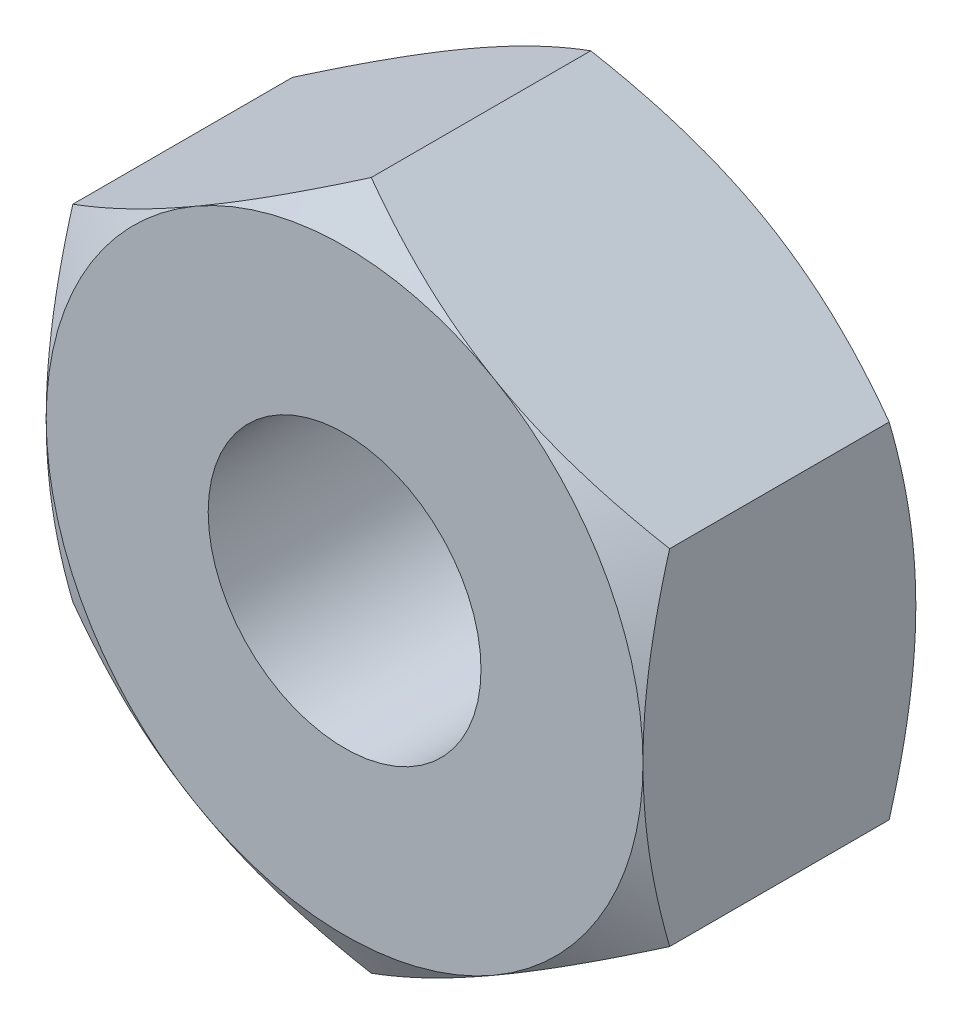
ISO-10303-21;
HEADER;
FILE_DESCRIPTION(('STEP AP214'),'2;1');
FILE_NAME('part.step','',(''),(''),'','','');
FILE_SCHEMA(('AUTOMOTIVE_DESIGN { 1 0 10303 214 1 1 1 1 }'));
ENDSEC;
DATA;
#1=APPLICATION_CONTEXT('core data for automotive mechanical design processes');
#2=APPLICATION_PROTOCOL_DEFINITION('international standard','automotive_design',2000,#1);
#3=PRODUCT_CONTEXT('',#1,'mechanical');
#4=PRODUCT('Part','Part','',(#3));
#5=PRODUCT_RELATED_PRODUCT_CATEGORY('part','',(#4));
#6=PRODUCT_DEFINITION_FORMATION('','',#4);
#7=PRODUCT_DEFINITION_CONTEXT('part definition',#1,'design');
#8=PRODUCT_DEFINITION('design','',#6,#7);
#9=PRODUCT_DEFINITION_SHAPE('','',#8);
#10=(LENGTH_UNIT() NAMED_UNIT(*) SI_UNIT(.MILLI.,.METRE.));
#11=(NAMED_UNIT(*) PLANE_ANGLE_UNIT() SI_UNIT($,.RADIAN.));
#12=(NAMED_UNIT(*) SI_UNIT($,.STERADIAN.) SOLID_ANGLE_UNIT());
#13=UNCERTAINTY_MEASURE_WITH_UNIT(LENGTH_MEASURE(1.E-05),#10,'distance_accuracy_value','');
#14=(GEOMETRIC_REPRESENTATION_CONTEXT(3) GLOBAL_UNCERTAINTY_ASSIGNED_CONTEXT((#13)) GLOBAL_UNIT_ASSIGNED_CONTEXT((#10,
#11,#12)) REPRESENTATION_CONTEXT('',''));
#15=CARTESIAN_POINT('',(0.,0.,0.));
#16=DIRECTION('',(0.,0.,1.));
#17=DIRECTION('',(1.,0.,0.));
#18=AXIS2_PLACEMENT_3D('',#15,#16,#17);
#19=CARTESIAN_POINT('',(-3.5,6.06217782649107,0.));
#20=DIRECTION('',(0.,0.,-1.));
#21=DIRECTION('',(-1.,0.,0.));
#22=AXIS2_PLACEMENT_3D('',#19,#20,#21);
#23=PLANE('',#22);
#24=CARTESIAN_POINT('',(0.,0.,0.));
#25=DIRECTION('',(0.,0.,1.));
#26=DIRECTION('',(1.,0.,0.));
#27=AXIS2_PLACEMENT_3D('',#24,#25,#26);
#28=CIRCLE('',#27,1.6);
#29=CARTESIAN_POINT('',(1.6,0.,0.));
#30=VERTEX_POINT('',#29);
#31=EDGE_CURVE('E315',#30,#30,#28,.T.);
#32=ORIENTED_EDGE('',*,*,#31,.F.);
#33=EDGE_LOOP('',(#32));
#34=FACE_BOUND('',#33,.T.);
#35=CARTESIAN_POINT('',(0.,0.,0.));
#36=DIRECTION('',(0.,0.,-1.));
#37=DIRECTION('',(-1.,0.,0.));
#38=AXIS2_PLACEMENT_3D('',#35,#36,#37);
#39=CIRCLE('',#38,3.5);
#40=CARTESIAN_POINT('',(-3.5,0.,0.));
#41=VERTEX_POINT('',#40);
#42=CARTESIAN_POINT('',(-1.75,3.03108891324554,0.));
#43=VERTEX_POINT('',#42);
#44=EDGE_CURVE('E323',#41,#43,#39,.T.);
#45=ORIENTED_EDGE('',*,*,#44,.F.);
#46=CARTESIAN_POINT('',(0.,0.,0.));
#47=DIRECTION('',(0.,0.,-1.));
#48=DIRECTION('',(-1.,0.,0.));
#49=AXIS2_PLACEMENT_3D('',#46,#47,#48);
#50=CIRCLE('',#49,3.5);
#51=CARTESIAN_POINT('',(-1.75,-3.03108891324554,0.));
#52=VERTEX_POINT('',#51);
#53=EDGE_CURVE('E145',#41,#52,#50,.F.);
#54=ORIENTED_EDGE('',*,*,#53,.T.);
#55=CARTESIAN_POINT('',(1.75,-3.03108891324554,0.));
#56=VERTEX_POINT('',#55);
#57=EDGE_CURVE('E247',#52,#56,#50,.F.);
#58=ORIENTED_EDGE('',*,*,#57,.T.);
#59=CARTESIAN_POINT('',(3.5,0.,0.));
#60=VERTEX_POINT('',#59);
#61=EDGE_CURVE('E148',#56,#60,#50,.F.);
#62=ORIENTED_EDGE('',*,*,#61,.T.);
#63=CARTESIAN_POINT('',(1.75,3.03108891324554,0.));
#64=VERTEX_POINT('',#63);
#65=EDGE_CURVE('E123',#60,#64,#50,.F.);
#66=ORIENTED_EDGE('',*,*,#65,.T.);
#67=EDGE_CURVE('E136',#64,#43,#50,.F.);
#68=ORIENTED_EDGE('',*,*,#67,.T.);
#69=EDGE_LOOP('',(#45,#54,#58,#62,#66,#68));
#70=FACE_BOUND('',#69,.T.);
#71=ADVANCED_FACE('F28',(#34,#70),#23,.F.);
#72=CARTESIAN_POINT('',(0.,0.,0.));
#73=DIRECTION('',(0.,0.,-1.));
#74=DIRECTION('',(-1.,0.,0.));
#75=AXIS2_PLACEMENT_3D('',#72,#73,#74);
#76=CONICAL_SURFACE('',#75,3.5,1.0471975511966);
#77=CARTESIAN_POINT('',(-3.5,-5.53989236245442,-1.76258862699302));
#78=CARTESIAN_POINT('',(-3.5,-5.3860532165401,-1.68751948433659));
#79=CARTESIAN_POINT('',(-3.5,-5.23187272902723,-1.61313843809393));
#80=CARTESIAN_POINT('',(-3.5,-4.92264796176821,-1.46613741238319));
#81=CARTESIAN_POINT('',(-3.5,-4.76760355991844,-1.39351769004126));
#82=CARTESIAN_POINT('',(-3.5,-4.45572331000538,-1.25008237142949));
#83=CARTESIAN_POINT('',(-3.5,-4.29888236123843,-1.17927782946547));
#84=CARTESIAN_POINT('',(-3.5,-3.9839916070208,-1.04042037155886));
#85=CARTESIAN_POINT('',(-3.5,-3.82594185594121,-0.972367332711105));
#86=CARTESIAN_POINT('',(-3.5,-3.50286160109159,-0.837429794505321));
#87=CARTESIAN_POINT('',(-3.5,-3.33777947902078,-0.770668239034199));
#88=CARTESIAN_POINT('',(-3.5,-3.00572557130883,-0.641932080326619));
#89=CARTESIAN_POINT('',(-3.5,-2.83875358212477,-0.579957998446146));
#90=CARTESIAN_POINT('',(-3.5,-2.50293236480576,-0.462342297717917));
#91=CARTESIAN_POINT('',(-3.5,-2.33408734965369,-0.40668876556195));
#92=CARTESIAN_POINT('',(-3.5,-1.99397751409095,-0.303425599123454));
#93=CARTESIAN_POINT('',(-3.5,-1.82271343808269,-0.255813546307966));
#94=CARTESIAN_POINT('',(-3.5,-1.4786457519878,-0.171103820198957));
#95=CARTESIAN_POINT('',(-3.5,-1.30585748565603,-0.133944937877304));
#96=CARTESIAN_POINT('',(-3.5,-0.958019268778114,-0.0721569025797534));
#97=CARTESIAN_POINT('',(-3.5,-0.782969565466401,-0.04752639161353));
#98=CARTESIAN_POINT('',(-3.5,-0.433812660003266,-0.0130761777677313));
#99=CARTESIAN_POINT('',(-3.5,-0.259725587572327,-0.00305750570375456));
#100=CARTESIAN_POINT('',(-3.5,0.0886801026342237,0.00185116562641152));
#101=CARTESIAN_POINT('',(-3.5,0.262998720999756,-0.00325887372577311));
#102=CARTESIAN_POINT('',(-3.5,0.555719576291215,-0.0241715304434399));
#103=CARTESIAN_POINT('',(-3.5,0.674418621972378,-0.0360937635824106));
#104=CARTESIAN_POINT('',(-3.5,0.911014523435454,-0.0662689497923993));
#105=CARTESIAN_POINT('',(-3.5,1.02891127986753,-0.0845226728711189));
#106=CARTESIAN_POINT('',(-3.5,1.38120423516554,-0.147828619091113));
#107=CARTESIAN_POINT('',(-3.5,1.6140874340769,-0.201416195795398));
#108=CARTESIAN_POINT('',(-3.5,1.96246692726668,-0.295188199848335));
#109=CARTESIAN_POINT('',(-3.5,2.07974536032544,-0.329136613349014));
#110=CARTESIAN_POINT('',(-3.5,2.31316562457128,-0.400772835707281));
#111=CARTESIAN_POINT('',(-3.5,2.42930744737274,-0.438460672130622));
#112=CARTESIAN_POINT('',(-3.5,2.66048730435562,-0.516953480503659));
#113=CARTESIAN_POINT('',(-3.5,2.77552563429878,-0.557757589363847));
#114=CARTESIAN_POINT('',(-3.5,3.00463505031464,-0.641981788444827));
#115=CARTESIAN_POINT('',(-3.5,3.11870615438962,-0.685401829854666));
#116=CARTESIAN_POINT('',(-3.5,3.41088605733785,-0.799847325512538));
#117=CARTESIAN_POINT('',(-3.5,3.58836543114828,-0.872477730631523));
#118=CARTESIAN_POINT('',(-3.5,3.9415935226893,-1.02184558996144));
#119=CARTESIAN_POINT('',(-3.5,4.11734207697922,-1.09858342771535));
#120=CARTESIAN_POINT('',(-3.5,4.46747042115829,-1.25524955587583));
#121=CARTESIAN_POINT('',(-3.5,4.64184978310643,-1.33517879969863));
#122=CARTESIAN_POINT('',(-3.5,4.98945002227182,-1.49752225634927));
#123=CARTESIAN_POINT('',(-3.5,5.16267086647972,-1.57993653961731));
#124=CARTESIAN_POINT('',(-3.5,5.68141043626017,-1.83034120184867));
#125=CARTESIAN_POINT('',(-3.5,6.02551030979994,-2.00126768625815));
#126=CARTESIAN_POINT('',(-3.5,6.71106540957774,-2.34815565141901));
#127=CARTESIAN_POINT('',(-3.5,7.05252109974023,-2.52411622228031));
#128=CARTESIAN_POINT('',(-3.5,7.70032644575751,-2.86216222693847));
#129=CARTESIAN_POINT('',(-3.5,8.00684578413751,-3.02392309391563));
#130=CARTESIAN_POINT('',(-3.5,8.61878605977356,-3.34954435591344));
#131=CARTESIAN_POINT('',(-3.5,8.92420693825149,-3.51340486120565));
#132=CARTESIAN_POINT('',(-3.5,9.53323628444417,-3.84217810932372));
#133=CARTESIAN_POINT('',(-3.5,9.836847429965,-4.00708589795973));
#134=CARTESIAN_POINT('',(-3.5,10.4433788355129,-4.33811602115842));
#135=CARTESIAN_POINT('',(-3.5,10.746299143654,-4.50423826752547));
#136=CARTESIAN_POINT('',(-3.5,11.0489725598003,-4.67080588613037));
#137=B_SPLINE_CURVE_WITH_KNOTS('',3,(#77,#78,#79,#80,#81,#82,#83,#84,#85,#86,#87,#88,#89,#90,
#91,#92,#93,#94,#95,#96,#97,#98,#99,#100,#101,#102,#103,#104,#105,#106,#107,#108,#109,#110,#111,
#112,#113,#114,#115,#116,#117,#118,#119,#120,#121,#122,#123,#124,#125,#126,#127,#128,#129,#130,
#131,#132,#133,#134,#135,#136),.UNSPECIFIED.,.F.,.F.,(4,2,2,2,2,2,2,2,2,2,2,2,2,2,2,2,2,2,2,2,2,
2,2,2,2,2,2,2,2,4),(0.,0.513539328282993,1.02715317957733,1.5433792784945,2.0595822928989,
2.59373725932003,3.12795031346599,3.6611391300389,4.19416729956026,4.72400604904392,
5.25378735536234,5.77628502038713,6.29878401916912,6.65650136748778,7.0142622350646,
7.73013057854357,8.09637575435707,8.46262363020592,8.82877043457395,9.19491040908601,
9.77013340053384,10.3454101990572,10.9208601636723,11.4963264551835,12.6488931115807,
13.8012527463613,14.840994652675,15.8807913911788,16.9173059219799,17.9537459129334),.UNSPECIFIED.);
#138=CARTESIAN_POINT('',(-3.5,2.0207259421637,-0.312607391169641));
#139=VERTEX_POINT('',#138);
#140=EDGE_CURVE('E153',#139,#41,#137,.F.);
#141=ORIENTED_EDGE('',*,*,#140,.T.);
#142=ORIENTED_EDGE('',*,*,#44,.T.);
#143=CARTESIAN_POINT('',(0.0002,4.04156735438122,-0.312674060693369));
#144=CARTESIAN_POINT('',(-0.153607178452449,3.9527667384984,-0.261385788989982));
#145=CARTESIAN_POINT('',(-0.308742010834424,3.86319960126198,-0.214740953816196));
#146=CARTESIAN_POINT('',(-0.621698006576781,3.68251437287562,-0.133321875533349));
#147=CARTESIAN_POINT('',(-0.779524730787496,3.59139307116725,-0.0985764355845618));
#148=CARTESIAN_POINT('',(-1.09322221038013,3.41027974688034,-0.0444900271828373));
#149=CARTESIAN_POINT('',(-1.24904469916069,3.32031559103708,-0.0247890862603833));
#150=CARTESIAN_POINT('',(-1.56142288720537,3.13996396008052,-0.0012701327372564));
#151=CARTESIAN_POINT('',(-1.71797745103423,3.04957714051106,0.00256735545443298));
#152=CARTESIAN_POINT('',(-2.01050921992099,2.88068384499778,-0.00541530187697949));
#153=CARTESIAN_POINT('',(-2.14653021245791,2.80215208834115,-0.0152754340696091));
#154=CARTESIAN_POINT('',(-2.41768602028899,2.64560020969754,-0.0465264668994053));
#155=CARTESIAN_POINT('',(-2.55281989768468,2.5675806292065,-0.0679280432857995));
#156=CARTESIAN_POINT('',(-2.82453479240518,2.41070596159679,-0.121430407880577));
#157=CARTESIAN_POINT('',(-2.96108141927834,2.33187072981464,-0.153757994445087));
#158=CARTESIAN_POINT('',(-3.2321380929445,2.17537608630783,-0.227128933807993));
#159=CARTESIAN_POINT('',(-3.36665161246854,2.09771466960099,-0.268155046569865));
#160=CARTESIAN_POINT('',(-3.5002,2.02061047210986,-0.312674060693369));
#161=B_SPLINE_CURVE_WITH_KNOTS('',3,(#143,#144,#145,#146,#147,#148,#149,#150,#151,#152,#153,
#154,#155,#156,#157,#158,#159,#160),.UNSPECIFIED.,.F.,.F.,(4,2,2,2,2,2,2,2,4),(0.,
0.554793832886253,1.11092123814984,1.65328467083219,2.19498204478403,2.6666513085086,
3.13875761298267,3.62133612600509,4.10296698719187),.UNSPECIFIED.);
#162=EDGE_CURVE('E185',#43,#139,#161,.T.);
#163=ORIENTED_EDGE('',*,*,#162,.T.);
#164=EDGE_LOOP('',(#141,#142,#163));
#165=FACE_BOUND('',#164,.T.);
#166=ADVANCED_FACE('F172',(#165),#76,.T.);
#167=CARTESIAN_POINT('',(3.5002,2.02061047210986,-0.312674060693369));
#168=CARTESIAN_POINT('',(3.34639282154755,2.10941108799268,-0.261385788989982));
#169=CARTESIAN_POINT('',(3.19125798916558,2.1989782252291,-0.214740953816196));
#170=CARTESIAN_POINT('',(2.87830199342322,2.37966345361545,-0.133321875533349));
#171=CARTESIAN_POINT('',(2.7204752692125,2.47078475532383,-0.0985764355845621));
#172=CARTESIAN_POINT('',(2.40677778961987,2.65189807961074,-0.0444900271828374));
#173=CARTESIAN_POINT('',(2.25095530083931,2.741862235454,-0.0247890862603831));
#174=CARTESIAN_POINT('',(1.93857711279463,2.92221386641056,-0.00127013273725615));
#175=CARTESIAN_POINT('',(1.78202254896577,3.01260068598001,0.00256735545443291));
#176=CARTESIAN_POINT('',(1.48949078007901,3.1814939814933,-0.00541530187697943));
#177=CARTESIAN_POINT('',(1.35346978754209,3.26002573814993,-0.0152754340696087));
#178=CARTESIAN_POINT('',(1.08231397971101,3.41657761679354,-0.0465264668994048));
#179=CARTESIAN_POINT('',(0.947180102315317,3.49459719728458,-0.0679280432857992));
#180=CARTESIAN_POINT('',(0.675465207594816,3.65147186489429,-0.121430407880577));
#181=CARTESIAN_POINT('',(0.538918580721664,3.73030709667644,-0.153757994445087));
#182=CARTESIAN_POINT('',(0.267861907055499,3.88680174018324,-0.227128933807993));
#183=CARTESIAN_POINT('',(0.133348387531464,3.96446315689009,-0.268155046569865));
#184=CARTESIAN_POINT('',(-0.000200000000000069,4.04156735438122,-0.312674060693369));
#185=B_SPLINE_CURVE_WITH_KNOTS('',3,(#167,#168,#169,#170,#171,#172,#173,#174,#175,#176,#177,
#178,#179,#180,#181,#182,#183,#184),.UNSPECIFIED.,.F.,.F.,(4,2,2,2,2,2,2,2,4),(0.,
0.554793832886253,1.11092123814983,1.65328467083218,2.19498204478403,2.6666513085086,
3.13875761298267,3.62133612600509,4.10296698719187),.UNSPECIFIED.);
#186=CARTESIAN_POINT('',(0.,4.04145188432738,-0.312607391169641));
#187=VERTEX_POINT('',#186);
#188=EDGE_CURVE('E132',#64,#187,#185,.T.);
#189=ORIENTED_EDGE('',*,*,#188,.T.);
#190=EDGE_CURVE('E139',#187,#43,#161,.T.);
#191=ORIENTED_EDGE('',*,*,#190,.T.);
#192=ORIENTED_EDGE('',*,*,#67,.F.);
#193=EDGE_LOOP('',(#189,#191,#192));
#194=FACE_BOUND('',#193,.T.);
#195=ADVANCED_FACE('F137',(#194),#76,.T.);
#196=CARTESIAN_POINT('',(3.5,-5.53989236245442,-1.76258862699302));
#197=CARTESIAN_POINT('',(3.5,-5.3860532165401,-1.68751948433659));
#198=CARTESIAN_POINT('',(3.5,-5.23187272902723,-1.61313843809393));
#199=CARTESIAN_POINT('',(3.5,-4.92264796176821,-1.46613741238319));
#200=CARTESIAN_POINT('',(3.5,-4.76760355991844,-1.39351769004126));
#201=CARTESIAN_POINT('',(3.5,-4.45572331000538,-1.25008237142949));
#202=CARTESIAN_POINT('',(3.5,-4.29888236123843,-1.17927782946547));
#203=CARTESIAN_POINT('',(3.5,-3.9839916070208,-1.04042037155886));
#204=CARTESIAN_POINT('',(3.5,-3.82594185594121,-0.972367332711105));
#205=CARTESIAN_POINT('',(3.5,-3.50286160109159,-0.837429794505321));
#206=CARTESIAN_POINT('',(3.5,-3.33777947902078,-0.770668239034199));
#207=CARTESIAN_POINT('',(3.5,-3.00572557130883,-0.641932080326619));
#208=CARTESIAN_POINT('',(3.5,-2.83875358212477,-0.579957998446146));
#209=CARTESIAN_POINT('',(3.5,-2.50293236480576,-0.462342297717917));
#210=CARTESIAN_POINT('',(3.5,-2.33408734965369,-0.40668876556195));
#211=CARTESIAN_POINT('',(3.5,-1.99397751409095,-0.303425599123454));
#212=CARTESIAN_POINT('',(3.5,-1.82271343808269,-0.255813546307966));
#213=CARTESIAN_POINT('',(3.5,-1.4786457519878,-0.171103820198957));
#214=CARTESIAN_POINT('',(3.5,-1.30585748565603,-0.133944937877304));
#215=CARTESIAN_POINT('',(3.5,-0.958019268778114,-0.0721569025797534));
#216=CARTESIAN_POINT('',(3.5,-0.782969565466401,-0.04752639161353));
#217=CARTESIAN_POINT('',(3.5,-0.433812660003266,-0.0130761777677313));
#218=CARTESIAN_POINT('',(3.5,-0.259725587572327,-0.00305750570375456));
#219=CARTESIAN_POINT('',(3.5,0.0886801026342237,0.00185116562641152));
#220=CARTESIAN_POINT('',(3.5,0.262998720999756,-0.00325887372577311));
#221=CARTESIAN_POINT('',(3.5,0.555719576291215,-0.0241715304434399));
#222=CARTESIAN_POINT('',(3.5,0.674418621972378,-0.0360937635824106));
#223=CARTESIAN_POINT('',(3.5,0.911014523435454,-0.0662689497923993));
#224=CARTESIAN_POINT('',(3.5,1.02891127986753,-0.0845226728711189));
#225=CARTESIAN_POINT('',(3.5,1.38120423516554,-0.147828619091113));
#226=CARTESIAN_POINT('',(3.5,1.6140874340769,-0.201416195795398));
#227=CARTESIAN_POINT('',(3.5,1.96246692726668,-0.295188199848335));
#228=CARTESIAN_POINT('',(3.5,2.07974536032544,-0.329136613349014));
#229=CARTESIAN_POINT('',(3.5,2.31316562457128,-0.400772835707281));
#230=CARTESIAN_POINT('',(3.5,2.42930744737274,-0.438460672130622));
#231=CARTESIAN_POINT('',(3.5,2.66048730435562,-0.516953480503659));
#232=CARTESIAN_POINT('',(3.5,2.77552563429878,-0.557757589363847));
#233=CARTESIAN_POINT('',(3.5,3.00463505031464,-0.641981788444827));
#234=CARTESIAN_POINT('',(3.5,3.11870615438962,-0.685401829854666));
#235=CARTESIAN_POINT('',(3.5,3.41088605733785,-0.799847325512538));
#236=CARTESIAN_POINT('',(3.5,3.58836543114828,-0.872477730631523));
#237=CARTESIAN_POINT('',(3.5,3.9415935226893,-1.02184558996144));
#238=CARTESIAN_POINT('',(3.5,4.11734207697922,-1.09858342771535));
#239=CARTESIAN_POINT('',(3.5,4.46747042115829,-1.25524955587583));
#240=CARTESIAN_POINT('',(3.5,4.64184978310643,-1.33517879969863));
#241=CARTESIAN_POINT('',(3.5,4.98945002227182,-1.49752225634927));
#242=CARTESIAN_POINT('',(3.5,5.16267086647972,-1.57993653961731));
#243=CARTESIAN_POINT('',(3.5,5.68141043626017,-1.83034120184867));
#244=CARTESIAN_POINT('',(3.5,6.02551030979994,-2.00126768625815));
#245=CARTESIAN_POINT('',(3.5,6.71106540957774,-2.34815565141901));
#246=CARTESIAN_POINT('',(3.5,7.05252109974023,-2.52411622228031));
#247=CARTESIAN_POINT('',(3.5,7.70032644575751,-2.86216222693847));
#248=CARTESIAN_POINT('',(3.5,8.00684578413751,-3.02392309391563));
#249=CARTESIAN_POINT('',(3.5,8.61878605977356,-3.34954435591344));
#250=CARTESIAN_POINT('',(3.5,8.92420693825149,-3.51340486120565));
#251=CARTESIAN_POINT('',(3.5,9.53323628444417,-3.84217810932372));
#252=CARTESIAN_POINT('',(3.5,9.836847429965,-4.00708589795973));
#253=CARTESIAN_POINT('',(3.5,10.4433788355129,-4.33811602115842));
#254=CARTESIAN_POINT('',(3.5,10.746299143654,-4.50423826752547));
#255=CARTESIAN_POINT('',(3.5,11.0489725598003,-4.67080588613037));
#256=B_SPLINE_CURVE_WITH_KNOTS('',3,(#196,#197,#198,#199,#200,#201,#202,#203,#204,#205,#206,
#207,#208,#209,#210,#211,#212,#213,#214,#215,#216,#217,#218,#219,#220,#221,#222,#223,#224,#225,
#226,#227,#228,#229,#230,#231,#232,#233,#234,#235,#236,#237,#238,#239,#240,#241,#242,#243,#244,
#245,#246,#247,#248,#249,#250,#251,#252,#253,#254,#255),.UNSPECIFIED.,.F.,.F.,(4,2,2,2,2,2,2,2,
2,2,2,2,2,2,2,2,2,2,2,2,2,2,2,2,2,2,2,2,2,4),(0.,0.513539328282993,1.02715317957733,
1.5433792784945,2.0595822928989,2.59373725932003,3.12795031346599,3.6611391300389,
4.19416729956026,4.72400604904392,5.25378735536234,5.77628502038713,6.29878401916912,
6.65650136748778,7.0142622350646,7.73013057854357,8.09637575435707,8.46262363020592,
8.82877043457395,9.19491040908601,9.77013340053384,10.3454101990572,10.9208601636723,
11.4963264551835,12.6488931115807,13.8012527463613,14.840994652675,15.8807913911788,
16.9173059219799,17.9537459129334),.UNSPECIFIED.);
#257=CARTESIAN_POINT('',(3.5,2.0207259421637,-0.312607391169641));
#258=VERTEX_POINT('',#257);
#259=EDGE_CURVE('E126',#60,#258,#256,.T.);
#260=ORIENTED_EDGE('',*,*,#259,.T.);
#261=EDGE_CURVE('E119',#258,#64,#185,.T.);
#262=ORIENTED_EDGE('',*,*,#261,.T.);
#263=ORIENTED_EDGE('',*,*,#65,.F.);
#264=EDGE_LOOP('',(#260,#262,#263));
#265=FACE_BOUND('',#264,.T.);
#266=ADVANCED_FACE('F121',(#265),#76,.T.);
#267=CARTESIAN_POINT('',(-0.0002,-4.04156735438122,-0.312674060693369));
#268=CARTESIAN_POINT('',(0.153607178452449,-3.9527667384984,-0.261385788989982));
#269=CARTESIAN_POINT('',(0.308742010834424,-3.86319960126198,-0.214740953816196));
#270=CARTESIAN_POINT('',(0.621698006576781,-3.68251437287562,-0.133321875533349));
#271=CARTESIAN_POINT('',(0.779524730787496,-3.59139307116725,-0.0985764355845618));
#272=CARTESIAN_POINT('',(1.09322221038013,-3.41027974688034,-0.0444900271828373));
#273=CARTESIAN_POINT('',(1.24904469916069,-3.32031559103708,-0.0247890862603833));
#274=CARTESIAN_POINT('',(1.56142288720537,-3.13996396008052,-0.0012701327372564));
#275=CARTESIAN_POINT('',(1.71797745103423,-3.04957714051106,0.00256735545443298));
#276=CARTESIAN_POINT('',(2.01050921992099,-2.88068384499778,-0.00541530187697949));
#277=CARTESIAN_POINT('',(2.14653021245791,-2.80215208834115,-0.0152754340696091));
#278=CARTESIAN_POINT('',(2.41768602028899,-2.64560020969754,-0.0465264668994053));
#279=CARTESIAN_POINT('',(2.55281989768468,-2.5675806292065,-0.0679280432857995));
#280=CARTESIAN_POINT('',(2.82453479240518,-2.41070596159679,-0.121430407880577));
#281=CARTESIAN_POINT('',(2.96108141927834,-2.33187072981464,-0.153757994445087));
#282=CARTESIAN_POINT('',(3.2321380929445,-2.17537608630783,-0.227128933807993));
#283=CARTESIAN_POINT('',(3.36665161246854,-2.09771466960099,-0.268155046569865));
#284=CARTESIAN_POINT('',(3.5002,-2.02061047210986,-0.312674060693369));
#285=B_SPLINE_CURVE_WITH_KNOTS('',3,(#267,#268,#269,#270,#271,#272,#273,#274,#275,#276,#277,
#278,#279,#280,#281,#282,#283,#284),.UNSPECIFIED.,.F.,.F.,(4,2,2,2,2,2,2,2,4),(0.,
0.554793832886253,1.11092123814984,1.65328467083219,2.19498204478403,2.6666513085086,
3.13875761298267,3.62133612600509,4.10296698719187),.UNSPECIFIED.);
#286=CARTESIAN_POINT('',(3.5,-2.0207259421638,-0.312607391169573));
#287=VERTEX_POINT('',#286);
#288=EDGE_CURVE('E199',#56,#287,#285,.T.);
#289=ORIENTED_EDGE('',*,*,#288,.T.);
#290=EDGE_CURVE('E198',#287,#60,#256,.T.);
#291=ORIENTED_EDGE('',*,*,#290,.T.);
#292=ORIENTED_EDGE('',*,*,#61,.F.);
#293=EDGE_LOOP('',(#289,#291,#292));
#294=FACE_BOUND('',#293,.T.);
#295=ADVANCED_FACE('F423',(#294),#76,.T.);
#296=CARTESIAN_POINT('',(0.,-4.04145188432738,-0.312607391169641));
#297=VERTEX_POINT('',#296);
#298=EDGE_CURVE('E257',#297,#56,#285,.T.);
#299=ORIENTED_EDGE('',*,*,#298,.T.);
#300=ORIENTED_EDGE('',*,*,#57,.F.);
#301=CARTESIAN_POINT('',(-3.5002,-2.02061047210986,-0.312674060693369));
#302=CARTESIAN_POINT('',(-3.34639282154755,-2.10941108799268,-0.261385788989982));
#303=CARTESIAN_POINT('',(-3.19125798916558,-2.1989782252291,-0.214740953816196));
#304=CARTESIAN_POINT('',(-2.87830199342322,-2.37966345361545,-0.133321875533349));
#305=CARTESIAN_POINT('',(-2.7204752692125,-2.47078475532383,-0.0985764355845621));
#306=CARTESIAN_POINT('',(-2.40677778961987,-2.65189807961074,-0.0444900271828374));
#307=CARTESIAN_POINT('',(-2.25095530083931,-2.741862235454,-0.0247890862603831));
#308=CARTESIAN_POINT('',(-1.93857711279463,-2.92221386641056,-0.00127013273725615));
#309=CARTESIAN_POINT('',(-1.78202254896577,-3.01260068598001,0.00256735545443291));
#310=CARTESIAN_POINT('',(-1.48949078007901,-3.1814939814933,-0.00541530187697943));
#311=CARTESIAN_POINT('',(-1.35346978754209,-3.26002573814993,-0.0152754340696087));
#312=CARTESIAN_POINT('',(-1.08231397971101,-3.41657761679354,-0.0465264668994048));
#313=CARTESIAN_POINT('',(-0.947180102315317,-3.49459719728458,-0.0679280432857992));
#314=CARTESIAN_POINT('',(-0.675465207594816,-3.65147186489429,-0.121430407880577));
#315=CARTESIAN_POINT('',(-0.538918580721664,-3.73030709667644,-0.153757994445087));
#316=CARTESIAN_POINT('',(-0.267861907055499,-3.88680174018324,-0.227128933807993));
#317=CARTESIAN_POINT('',(-0.133348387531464,-3.96446315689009,-0.268155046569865));
#318=CARTESIAN_POINT('',(0.000200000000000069,-4.04156735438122,-0.312674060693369));
#319=B_SPLINE_CURVE_WITH_KNOTS('',3,(#301,#302,#303,#304,#305,#306,#307,#308,#309,#310,#311,
#312,#313,#314,#315,#316,#317,#318),.UNSPECIFIED.,.F.,.F.,(4,2,2,2,2,2,2,2,4),(0.,
0.554793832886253,1.11092123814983,1.65328467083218,2.19498204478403,2.6666513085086,
3.13875761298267,3.62133612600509,4.10296698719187),.UNSPECIFIED.);
#320=EDGE_CURVE('E261',#52,#297,#319,.T.);
#321=ORIENTED_EDGE('',*,*,#320,.T.);
#322=EDGE_LOOP('',(#299,#300,#321));
#323=FACE_BOUND('',#322,.T.);
#324=ADVANCED_FACE('F178',(#323),#76,.T.);
#325=CARTESIAN_POINT('',(-3.5,-2.0207259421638,-0.312607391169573));
#326=VERTEX_POINT('',#325);
#327=EDGE_CURVE('E166',#326,#52,#319,.T.);
#328=ORIENTED_EDGE('',*,*,#327,.T.);
#329=ORIENTED_EDGE('',*,*,#53,.F.);
#330=EDGE_CURVE('E131',#41,#326,#137,.F.);
#331=ORIENTED_EDGE('',*,*,#330,.T.);
#332=EDGE_LOOP('',(#328,#329,#331));
#333=FACE_BOUND('',#332,.T.);
#334=ADVANCED_FACE('F266',(#333),#76,.T.);
#335=CARTESIAN_POINT('',(3.5,2.0207259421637,-3.2));
#336=DIRECTION('',(0.499999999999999,0.866025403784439,0.));
#337=DIRECTION('',(-0.866025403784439,0.499999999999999,0.));
#338=AXIS2_PLACEMENT_3D('',#335,#336,#337);
#339=PLANE('',#338);
#340=CARTESIAN_POINT('',(-0.0002,4.04156735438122,-2.88732593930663));
#341=CARTESIAN_POINT('',(0.153607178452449,3.9527667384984,-2.93861421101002));
#342=CARTESIAN_POINT('',(0.308742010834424,3.86319960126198,-2.9852590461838));
#343=CARTESIAN_POINT('',(0.621698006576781,3.68251437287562,-3.06667812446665));
#344=CARTESIAN_POINT('',(0.779524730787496,3.59139307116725,-3.10142356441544));
#345=CARTESIAN_POINT('',(1.09322221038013,3.41027974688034,-3.15550997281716));
#346=CARTESIAN_POINT('',(1.24904469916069,3.32031559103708,-3.17521091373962));
#347=CARTESIAN_POINT('',(1.56142288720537,3.13996396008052,-3.19872986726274));
#348=CARTESIAN_POINT('',(1.71797745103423,3.04957714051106,-3.20256735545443));
#349=CARTESIAN_POINT('',(2.01050921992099,2.88068384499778,-3.19458469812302));
#350=CARTESIAN_POINT('',(2.14653021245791,2.80215208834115,-3.18472456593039));
#351=CARTESIAN_POINT('',(2.41768602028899,2.64560020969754,-3.1534735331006));
#352=CARTESIAN_POINT('',(2.55281989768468,2.5675806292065,-3.1320719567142));
#353=CARTESIAN_POINT('',(2.82453479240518,2.41070596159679,-3.07856959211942));
#354=CARTESIAN_POINT('',(2.96108141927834,2.33187072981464,-3.04624200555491));
#355=CARTESIAN_POINT('',(3.2321380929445,2.17537608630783,-2.97287106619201));
#356=CARTESIAN_POINT('',(3.36665161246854,2.09771466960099,-2.93184495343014));
#357=CARTESIAN_POINT('',(3.5002,2.02061047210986,-2.88732593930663));
#358=B_SPLINE_CURVE_WITH_KNOTS('',3,(#340,#341,#342,#343,#344,#345,#346,#347,#348,#349,#350,
#351,#352,#353,#354,#355,#356,#357),.UNSPECIFIED.,.F.,.F.,(4,2,2,2,2,2,2,2,4),(0.,
0.554793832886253,1.11092123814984,1.65328467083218,2.19498204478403,2.6666513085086,
3.13875761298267,3.62133612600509,4.10296698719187),.UNSPECIFIED.);
#359=CARTESIAN_POINT('',(0.,4.04145188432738,-2.88739260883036));
#360=VERTEX_POINT('',#359);
#361=CARTESIAN_POINT('',(1.75,3.03108891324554,-3.2));
#362=VERTEX_POINT('',#361);
#363=EDGE_CURVE('E232',#360,#362,#358,.T.);
#364=ORIENTED_EDGE('',*,*,#363,.F.);
#365=DIRECTION('',(0.,0.,1.));
#366=VECTOR('',#365,1.);
#367=CARTESIAN_POINT('',(0.,4.04145188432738,-3.2));
#368=LINE('',#367,#366);
#369=EDGE_CURVE('E152',#360,#187,#368,.T.);
#370=ORIENTED_EDGE('',*,*,#369,.T.);
#371=ORIENTED_EDGE('',*,*,#188,.F.);
#372=ORIENTED_EDGE('',*,*,#261,.F.);
#373=DIRECTION('',(0.,0.,1.));
#374=VECTOR('',#373,1.);
#375=CARTESIAN_POINT('',(3.5,2.0207259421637,-3.2));
#376=LINE('',#375,#374);
#377=CARTESIAN_POINT('',(3.5,2.0207259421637,-2.88739260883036));
#378=VERTEX_POINT('',#377);
#379=EDGE_CURVE('E144',#378,#258,#376,.T.);
#380=ORIENTED_EDGE('',*,*,#379,.F.);
#381=EDGE_CURVE('E227',#362,#378,#358,.T.);
#382=ORIENTED_EDGE('',*,*,#381,.F.);
#383=EDGE_LOOP('',(#364,#370,#371,#372,#380,#382));
#384=FACE_BOUND('',#383,.T.);
#385=ADVANCED_FACE('F30',(#384),#339,.T.);
#386=CARTESIAN_POINT('',(3.5,-2.0207259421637,-3.2));
#387=DIRECTION('',(1.,0.,0.));
#388=DIRECTION('',(0.,0.,-1.));
#389=AXIS2_PLACEMENT_3D('',#386,#387,#388);
#390=PLANE('',#389);
#391=CARTESIAN_POINT('',(3.5,-5.53989236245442,-1.43741137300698));
#392=CARTESIAN_POINT('',(3.5,-5.3860532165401,-1.51248051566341));
#393=CARTESIAN_POINT('',(3.5,-5.23187272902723,-1.58686156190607));
#394=CARTESIAN_POINT('',(3.5,-4.92264796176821,-1.73386258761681));
#395=CARTESIAN_POINT('',(3.5,-4.76760355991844,-1.80648230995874));
#396=CARTESIAN_POINT('',(3.5,-4.45572331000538,-1.94991762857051));
#397=CARTESIAN_POINT('',(3.5,-4.29888236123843,-2.02072217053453));
#398=CARTESIAN_POINT('',(3.5,-3.9839916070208,-2.15957962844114));
#399=CARTESIAN_POINT('',(3.5,-3.82594185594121,-2.2276326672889));
#400=CARTESIAN_POINT('',(3.5,-3.50286160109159,-2.36257020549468));
#401=CARTESIAN_POINT('',(3.5,-3.33777947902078,-2.4293317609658));
#402=CARTESIAN_POINT('',(3.5,-3.00572557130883,-2.55806791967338));
#403=CARTESIAN_POINT('',(3.5,-2.83875358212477,-2.62004200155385));
#404=CARTESIAN_POINT('',(3.5,-2.50293236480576,-2.73765770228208));
#405=CARTESIAN_POINT('',(3.5,-2.33408734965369,-2.79331123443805));
#406=CARTESIAN_POINT('',(3.5,-1.99397751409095,-2.89657440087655));
#407=CARTESIAN_POINT('',(3.5,-1.82271343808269,-2.94418645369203));
#408=CARTESIAN_POINT('',(3.5,-1.4786457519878,-3.02889617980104));
#409=CARTESIAN_POINT('',(3.5,-1.30585748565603,-3.0660550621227));
#410=CARTESIAN_POINT('',(3.5,-0.958019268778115,-3.12784309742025));
#411=CARTESIAN_POINT('',(3.5,-0.782969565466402,-3.15247360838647));
#412=CARTESIAN_POINT('',(3.5,-0.433812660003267,-3.18692382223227));
#413=CARTESIAN_POINT('',(3.5,-0.259725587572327,-3.19694249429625));
#414=CARTESIAN_POINT('',(3.5,0.0886801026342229,-3.20185116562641));
#415=CARTESIAN_POINT('',(3.5,0.262998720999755,-3.19674112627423));
#416=CARTESIAN_POINT('',(3.5,0.555719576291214,-3.17582846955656));
#417=CARTESIAN_POINT('',(3.5,0.674418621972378,-3.16390623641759));
#418=CARTESIAN_POINT('',(3.5,0.911014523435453,-3.1337310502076));
#419=CARTESIAN_POINT('',(3.5,1.02891127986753,-3.11547732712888));
#420=CARTESIAN_POINT('',(3.5,1.38120423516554,-3.05217138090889));
#421=CARTESIAN_POINT('',(3.5,1.6140874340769,-2.9985838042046));
#422=CARTESIAN_POINT('',(3.5,1.96246692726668,-2.90481180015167));
#423=CARTESIAN_POINT('',(3.5,2.07974536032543,-2.87086338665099));
#424=CARTESIAN_POINT('',(3.5,2.31316562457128,-2.79922716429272));
#425=CARTESIAN_POINT('',(3.5,2.42930744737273,-2.76153932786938));
#426=CARTESIAN_POINT('',(3.5,2.66048730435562,-2.68304651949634));
#427=CARTESIAN_POINT('',(3.5,2.77552563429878,-2.64224241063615));
#428=CARTESIAN_POINT('',(3.5,3.00463505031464,-2.55801821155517));
#429=CARTESIAN_POINT('',(3.5,3.11870615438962,-2.51459817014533));
#430=CARTESIAN_POINT('',(3.5,3.41088605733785,-2.40015267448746));
#431=CARTESIAN_POINT('',(3.5,3.58836543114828,-2.32752226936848));
#432=CARTESIAN_POINT('',(3.5,3.94159352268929,-2.17815441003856));
#433=CARTESIAN_POINT('',(3.5,4.11734207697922,-2.10141657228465));
#434=CARTESIAN_POINT('',(3.5,4.46747042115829,-1.94475044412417));
#435=CARTESIAN_POINT('',(3.5,4.64184978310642,-1.86482120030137));
#436=CARTESIAN_POINT('',(3.5,4.98945002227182,-1.70247774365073));
#437=CARTESIAN_POINT('',(3.5,5.16267086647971,-1.62006346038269));
#438=CARTESIAN_POINT('',(3.5,5.68141043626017,-1.36965879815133));
#439=CARTESIAN_POINT('',(3.5,6.02551030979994,-1.19873231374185));
#440=CARTESIAN_POINT('',(3.5,6.71106540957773,-0.851844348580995));
#441=CARTESIAN_POINT('',(3.5,7.05252109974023,-0.675883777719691));
#442=CARTESIAN_POINT('',(3.5,7.70032644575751,-0.337837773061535));
#443=CARTESIAN_POINT('',(3.5,8.00684578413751,-0.176076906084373));
#444=CARTESIAN_POINT('',(3.5,8.61878605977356,0.149544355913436));
#445=CARTESIAN_POINT('',(3.5,8.92420693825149,0.313404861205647));
#446=CARTESIAN_POINT('',(3.5,9.53323628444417,0.642178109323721));
#447=CARTESIAN_POINT('',(3.5,9.836847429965,0.807085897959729));
#448=CARTESIAN_POINT('',(3.5,10.4433788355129,1.13811602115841));
#449=CARTESIAN_POINT('',(3.5,10.746299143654,1.30423826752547));
#450=CARTESIAN_POINT('',(3.5,11.0489725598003,1.47080588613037));
#451=B_SPLINE_CURVE_WITH_KNOTS('',3,(#391,#392,#393,#394,#395,#396,#397,#398,#399,#400,#401,
#402,#403,#404,#405,#406,#407,#408,#409,#410,#411,#412,#413,#414,#415,#416,#417,#418,#419,#420,
#421,#422,#423,#424,#425,#426,#427,#428,#429,#430,#431,#432,#433,#434,#435,#436,#437,#438,#439,
#440,#441,#442,#443,#444,#445,#446,#447,#448,#449,#450),.UNSPECIFIED.,.F.,.F.,(4,2,2,2,2,2,2,2,
2,2,2,2,2,2,2,2,2,2,2,2,2,2,2,2,2,2,2,2,2,4),(0.,0.513539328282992,1.02715317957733,
1.5433792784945,2.0595822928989,2.59373725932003,3.12795031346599,3.6611391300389,
4.19416729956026,4.72400604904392,5.25378735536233,5.77628502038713,6.29878401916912,
6.65650136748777,7.0142622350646,7.73013057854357,8.09637575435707,8.46262363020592,
8.82877043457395,9.19491040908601,9.77013340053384,10.3454101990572,10.9208601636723,
11.4963264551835,12.6488931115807,13.8012527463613,14.840994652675,15.8807913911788,
16.9173059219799,17.9537459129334),.UNSPECIFIED.);
#452=CARTESIAN_POINT('',(3.5,0.,-3.2));
#453=VERTEX_POINT('',#452);
#454=EDGE_CURVE('E221',#378,#453,#451,.F.);
#455=ORIENTED_EDGE('',*,*,#454,.F.);
#456=ORIENTED_EDGE('',*,*,#379,.T.);
#457=ORIENTED_EDGE('',*,*,#259,.F.);
#458=ORIENTED_EDGE('',*,*,#290,.F.);
#459=DIRECTION('',(0.,0.,1.));
#460=VECTOR('',#459,1.);
#461=CARTESIAN_POINT('',(3.5,-2.0207259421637,-3.2));
#462=LINE('',#461,#460);
#463=CARTESIAN_POINT('',(3.5,-2.0207259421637,-2.88739260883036));
#464=VERTEX_POINT('',#463);
#465=EDGE_CURVE('E234',#464,#287,#462,.T.);
#466=ORIENTED_EDGE('',*,*,#465,.F.);
#467=EDGE_CURVE('E215',#453,#464,#451,.F.);
#468=ORIENTED_EDGE('',*,*,#467,.F.);
#469=EDGE_LOOP('',(#455,#456,#457,#458,#466,#468));
#470=FACE_BOUND('',#469,.T.);
#471=ADVANCED_FACE('F205',(#470),#390,.T.);
#472=CARTESIAN_POINT('',(3.5,-2.0207259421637,-3.2));
#473=DIRECTION('',(0.499999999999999,-0.866025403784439,0.));
#474=DIRECTION('',(0.866025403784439,0.499999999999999,0.));
#475=AXIS2_PLACEMENT_3D('',#472,#473,#474);
#476=PLANE('',#475);
#477=CARTESIAN_POINT('',(3.5002,-2.02061047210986,-2.88732593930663));
#478=CARTESIAN_POINT('',(3.34639282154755,-2.10941108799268,-2.93861421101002));
#479=CARTESIAN_POINT('',(3.19125798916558,-2.1989782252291,-2.9852590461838));
#480=CARTESIAN_POINT('',(2.87830199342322,-2.37966345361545,-3.06667812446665));
#481=CARTESIAN_POINT('',(2.7204752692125,-2.47078475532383,-3.10142356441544));
#482=CARTESIAN_POINT('',(2.40677778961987,-2.65189807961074,-3.15550997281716));
#483=CARTESIAN_POINT('',(2.25095530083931,-2.741862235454,-3.17521091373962));
#484=CARTESIAN_POINT('',(1.93857711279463,-2.92221386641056,-3.19872986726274));
#485=CARTESIAN_POINT('',(1.78202254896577,-3.01260068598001,-3.20256735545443));
#486=CARTESIAN_POINT('',(1.48949078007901,-3.1814939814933,-3.19458469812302));
#487=CARTESIAN_POINT('',(1.35346978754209,-3.26002573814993,-3.18472456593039));
#488=CARTESIAN_POINT('',(1.08231397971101,-3.41657761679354,-3.1534735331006));
#489=CARTESIAN_POINT('',(0.947180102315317,-3.49459719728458,-3.1320719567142));
#490=CARTESIAN_POINT('',(0.675465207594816,-3.65147186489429,-3.07856959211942));
#491=CARTESIAN_POINT('',(0.538918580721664,-3.73030709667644,-3.04624200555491));
#492=CARTESIAN_POINT('',(0.267861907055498,-3.88680174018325,-2.97287106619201));
#493=CARTESIAN_POINT('',(0.133348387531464,-3.96446315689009,-2.93184495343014));
#494=CARTESIAN_POINT('',(-0.000200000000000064,-4.04156735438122,-2.88732593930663));
#495=B_SPLINE_CURVE_WITH_KNOTS('',3,(#477,#478,#479,#480,#481,#482,#483,#484,#485,#486,#487,
#488,#489,#490,#491,#492,#493,#494),.UNSPECIFIED.,.F.,.F.,(4,2,2,2,2,2,2,2,4),(0.,
0.554793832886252,1.11092123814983,1.65328467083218,2.19498204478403,2.6666513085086,
3.13875761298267,3.62133612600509,4.10296698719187),.UNSPECIFIED.);
#496=CARTESIAN_POINT('',(1.75,-3.03108891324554,-3.2));
#497=VERTEX_POINT('',#496);
#498=EDGE_CURVE('E52',#464,#497,#495,.T.);
#499=ORIENTED_EDGE('',*,*,#498,.F.);
#500=ORIENTED_EDGE('',*,*,#465,.T.);
#501=ORIENTED_EDGE('',*,*,#288,.F.);
#502=ORIENTED_EDGE('',*,*,#298,.F.);
#503=DIRECTION('',(0.,0.,1.));
#504=VECTOR('',#503,1.);
#505=CARTESIAN_POINT('',(0.,-4.04145188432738,-3.2));
#506=LINE('',#505,#504);
#507=CARTESIAN_POINT('',(0.,-4.04145188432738,-2.88739260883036));
#508=VERTEX_POINT('',#507);
#509=EDGE_CURVE('E237',#508,#297,#506,.T.);
#510=ORIENTED_EDGE('',*,*,#509,.F.);
#511=EDGE_CURVE('E222',#497,#508,#495,.T.);
#512=ORIENTED_EDGE('',*,*,#511,.F.);
#513=EDGE_LOOP('',(#499,#500,#501,#502,#510,#512));
#514=FACE_BOUND('',#513,.T.);
#515=ADVANCED_FACE('F209',(#514),#476,.T.);
#516=CARTESIAN_POINT('',(-3.5,-2.0207259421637,-3.2));
#517=DIRECTION('',(-0.499999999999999,-0.866025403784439,0.));
#518=DIRECTION('',(0.866025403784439,-0.499999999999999,0.));
#519=AXIS2_PLACEMENT_3D('',#516,#517,#518);
#520=PLANE('',#519);
#521=CARTESIAN_POINT('',(0.0002,-4.04156735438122,-2.88732593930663));
#522=CARTESIAN_POINT('',(-0.153607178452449,-3.9527667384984,-2.93861421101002));
#523=CARTESIAN_POINT('',(-0.308742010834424,-3.86319960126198,-2.9852590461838));
#524=CARTESIAN_POINT('',(-0.621698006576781,-3.68251437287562,-3.06667812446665));
#525=CARTESIAN_POINT('',(-0.779524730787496,-3.59139307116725,-3.10142356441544));
#526=CARTESIAN_POINT('',(-1.09322221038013,-3.41027974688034,-3.15550997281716));
#527=CARTESIAN_POINT('',(-1.24904469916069,-3.32031559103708,-3.17521091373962));
#528=CARTESIAN_POINT('',(-1.56142288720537,-3.13996396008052,-3.19872986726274));
#529=CARTESIAN_POINT('',(-1.71797745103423,-3.04957714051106,-3.20256735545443));
#530=CARTESIAN_POINT('',(-2.01050921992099,-2.88068384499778,-3.19458469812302));
#531=CARTESIAN_POINT('',(-2.14653021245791,-2.80215208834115,-3.18472456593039));
#532=CARTESIAN_POINT('',(-2.41768602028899,-2.64560020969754,-3.1534735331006));
#533=CARTESIAN_POINT('',(-2.55281989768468,-2.5675806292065,-3.1320719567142));
#534=CARTESIAN_POINT('',(-2.82453479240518,-2.41070596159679,-3.07856959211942));
#535=CARTESIAN_POINT('',(-2.96108141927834,-2.33187072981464,-3.04624200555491));
#536=CARTESIAN_POINT('',(-3.2321380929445,-2.17537608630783,-2.97287106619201));
#537=CARTESIAN_POINT('',(-3.36665161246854,-2.09771466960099,-2.93184495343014));
#538=CARTESIAN_POINT('',(-3.5002,-2.02061047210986,-2.88732593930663));
#539=B_SPLINE_CURVE_WITH_KNOTS('',3,(#521,#522,#523,#524,#525,#526,#527,#528,#529,#530,#531,
#532,#533,#534,#535,#536,#537,#538),.UNSPECIFIED.,.F.,.F.,(4,2,2,2,2,2,2,2,4),(0.,
0.554793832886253,1.11092123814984,1.65328467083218,2.19498204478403,2.6666513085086,
3.13875761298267,3.62133612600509,4.10296698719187),.UNSPECIFIED.);
#540=CARTESIAN_POINT('',(-1.75,-3.03108891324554,-3.2));
#541=VERTEX_POINT('',#540);
#542=EDGE_CURVE('E45',#508,#541,#539,.T.);
#543=ORIENTED_EDGE('',*,*,#542,.F.);
#544=ORIENTED_EDGE('',*,*,#509,.T.);
#545=ORIENTED_EDGE('',*,*,#320,.F.);
#546=ORIENTED_EDGE('',*,*,#327,.F.);
#547=DIRECTION('',(0.,0.,1.));
#548=VECTOR('',#547,1.);
#549=CARTESIAN_POINT('',(-3.5,-2.0207259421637,-3.2));
#550=LINE('',#549,#548);
#551=CARTESIAN_POINT('',(-3.5,-2.0207259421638,-2.88739260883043));
#552=VERTEX_POINT('',#551);
#553=EDGE_CURVE('E240',#552,#326,#550,.T.);
#554=ORIENTED_EDGE('',*,*,#553,.F.);
#555=EDGE_CURVE('E281',#541,#552,#539,.T.);
#556=ORIENTED_EDGE('',*,*,#555,.F.);
#557=EDGE_LOOP('',(#543,#544,#545,#546,#554,#556));
#558=FACE_BOUND('',#557,.T.);
#559=ADVANCED_FACE('F271',(#558),#520,.T.);
#560=CARTESIAN_POINT('',(-3.5,-2.0207259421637,-3.2));
#561=DIRECTION('',(-1.,0.,0.));
#562=DIRECTION('',(0.,0.,1.));
#563=AXIS2_PLACEMENT_3D('',#560,#561,#562);
#564=PLANE('',#563);
#565=CARTESIAN_POINT('',(-3.5,-5.53989236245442,-1.43741137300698));
#566=CARTESIAN_POINT('',(-3.5,-5.3860532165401,-1.51248051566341));
#567=CARTESIAN_POINT('',(-3.5,-5.23187272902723,-1.58686156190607));
#568=CARTESIAN_POINT('',(-3.5,-4.92264796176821,-1.73386258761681));
#569=CARTESIAN_POINT('',(-3.5,-4.76760355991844,-1.80648230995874));
#570=CARTESIAN_POINT('',(-3.5,-4.45572331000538,-1.94991762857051));
#571=CARTESIAN_POINT('',(-3.5,-4.29888236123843,-2.02072217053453));
#572=CARTESIAN_POINT('',(-3.5,-3.9839916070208,-2.15957962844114));
#573=CARTESIAN_POINT('',(-3.5,-3.82594185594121,-2.2276326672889));
#574=CARTESIAN_POINT('',(-3.5,-3.50286160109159,-2.36257020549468));
#575=CARTESIAN_POINT('',(-3.5,-3.33777947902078,-2.4293317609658));
#576=CARTESIAN_POINT('',(-3.5,-3.00572557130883,-2.55806791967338));
#577=CARTESIAN_POINT('',(-3.5,-2.83875358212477,-2.62004200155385));
#578=CARTESIAN_POINT('',(-3.5,-2.50293236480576,-2.73765770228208));
#579=CARTESIAN_POINT('',(-3.5,-2.33408734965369,-2.79331123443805));
#580=CARTESIAN_POINT('',(-3.5,-1.99397751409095,-2.89657440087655));
#581=CARTESIAN_POINT('',(-3.5,-1.82271343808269,-2.94418645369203));
#582=CARTESIAN_POINT('',(-3.5,-1.4786457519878,-3.02889617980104));
#583=CARTESIAN_POINT('',(-3.5,-1.30585748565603,-3.0660550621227));
#584=CARTESIAN_POINT('',(-3.5,-0.958019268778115,-3.12784309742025));
#585=CARTESIAN_POINT('',(-3.5,-0.782969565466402,-3.15247360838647));
#586=CARTESIAN_POINT('',(-3.5,-0.433812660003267,-3.18692382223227));
#587=CARTESIAN_POINT('',(-3.5,-0.259725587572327,-3.19694249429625));
#588=CARTESIAN_POINT('',(-3.5,0.0886801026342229,-3.20185116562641));
#589=CARTESIAN_POINT('',(-3.5,0.262998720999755,-3.19674112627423));
#590=CARTESIAN_POINT('',(-3.5,0.555719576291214,-3.17582846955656));
#591=CARTESIAN_POINT('',(-3.5,0.674418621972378,-3.16390623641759));
#592=CARTESIAN_POINT('',(-3.5,0.911014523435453,-3.1337310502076));
#593=CARTESIAN_POINT('',(-3.5,1.02891127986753,-3.11547732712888));
#594=CARTESIAN_POINT('',(-3.5,1.38120423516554,-3.05217138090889));
#595=CARTESIAN_POINT('',(-3.5,1.6140874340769,-2.9985838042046));
#596=CARTESIAN_POINT('',(-3.5,1.96246692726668,-2.90481180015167));
#597=CARTESIAN_POINT('',(-3.5,2.07974536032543,-2.87086338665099));
#598=CARTESIAN_POINT('',(-3.5,2.31316562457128,-2.79922716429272));
#599=CARTESIAN_POINT('',(-3.5,2.42930744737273,-2.76153932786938));
#600=CARTESIAN_POINT('',(-3.5,2.66048730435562,-2.68304651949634));
#601=CARTESIAN_POINT('',(-3.5,2.77552563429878,-2.64224241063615));
#602=CARTESIAN_POINT('',(-3.5,3.00463505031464,-2.55801821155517));
#603=CARTESIAN_POINT('',(-3.5,3.11870615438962,-2.51459817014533));
#604=CARTESIAN_POINT('',(-3.5,3.41088605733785,-2.40015267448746));
#605=CARTESIAN_POINT('',(-3.5,3.58836543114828,-2.32752226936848));
#606=CARTESIAN_POINT('',(-3.5,3.94159352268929,-2.17815441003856));
#607=CARTESIAN_POINT('',(-3.5,4.11734207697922,-2.10141657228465));
#608=CARTESIAN_POINT('',(-3.5,4.46747042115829,-1.94475044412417));
#609=CARTESIAN_POINT('',(-3.5,4.64184978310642,-1.86482120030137));
#610=CARTESIAN_POINT('',(-3.5,4.98945002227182,-1.70247774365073));
#611=CARTESIAN_POINT('',(-3.5,5.16267086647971,-1.62006346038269));
#612=CARTESIAN_POINT('',(-3.5,5.68141043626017,-1.36965879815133));
#613=CARTESIAN_POINT('',(-3.5,6.02551030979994,-1.19873231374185));
#614=CARTESIAN_POINT('',(-3.5,6.71106540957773,-0.851844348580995));
#615=CARTESIAN_POINT('',(-3.5,7.05252109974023,-0.675883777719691));
#616=CARTESIAN_POINT('',(-3.5,7.70032644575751,-0.337837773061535));
#617=CARTESIAN_POINT('',(-3.5,8.00684578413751,-0.176076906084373));
#618=CARTESIAN_POINT('',(-3.5,8.61878605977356,0.149544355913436));
#619=CARTESIAN_POINT('',(-3.5,8.92420693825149,0.313404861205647));
#620=CARTESIAN_POINT('',(-3.5,9.53323628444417,0.642178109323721));
#621=CARTESIAN_POINT('',(-3.5,9.836847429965,0.807085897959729));
#622=CARTESIAN_POINT('',(-3.5,10.4433788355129,1.13811602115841));
#623=CARTESIAN_POINT('',(-3.5,10.746299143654,1.30423826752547));
#624=CARTESIAN_POINT('',(-3.5,11.0489725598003,1.47080588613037));
#625=B_SPLINE_CURVE_WITH_KNOTS('',3,(#565,#566,#567,#568,#569,#570,#571,#572,#573,#574,#575,
#576,#577,#578,#579,#580,#581,#582,#583,#584,#585,#586,#587,#588,#589,#590,#591,#592,#593,#594,
#595,#596,#597,#598,#599,#600,#601,#602,#603,#604,#605,#606,#607,#608,#609,#610,#611,#612,#613,
#614,#615,#616,#617,#618,#619,#620,#621,#622,#623,#624),.UNSPECIFIED.,.F.,.F.,(4,2,2,2,2,2,2,2,
2,2,2,2,2,2,2,2,2,2,2,2,2,2,2,2,2,2,2,2,2,4),(0.,0.513539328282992,1.02715317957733,
1.5433792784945,2.0595822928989,2.59373725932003,3.12795031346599,3.6611391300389,
4.19416729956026,4.72400604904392,5.25378735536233,5.77628502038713,6.29878401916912,
6.65650136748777,7.0142622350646,7.73013057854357,8.09637575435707,8.46262363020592,
8.82877043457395,9.19491040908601,9.77013340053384,10.3454101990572,10.9208601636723,
11.4963264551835,12.6488931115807,13.8012527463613,14.840994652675,15.8807913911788,
16.9173059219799,17.9537459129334),.UNSPECIFIED.);
#626=CARTESIAN_POINT('',(-3.5,0.,-3.2));
#627=VERTEX_POINT('',#626);
#628=EDGE_CURVE('E276',#552,#627,#625,.T.);
#629=ORIENTED_EDGE('',*,*,#628,.F.);
#630=ORIENTED_EDGE('',*,*,#553,.T.);
#631=ORIENTED_EDGE('',*,*,#330,.F.);
#632=ORIENTED_EDGE('',*,*,#140,.F.);
#633=DIRECTION('',(0.,0.,1.));
#634=VECTOR('',#633,1.);
#635=CARTESIAN_POINT('',(-3.5,2.0207259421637,-3.2));
#636=LINE('',#635,#634);
#637=CARTESIAN_POINT('',(-3.5,2.0207259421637,-2.88739260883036));
#638=VERTEX_POINT('',#637);
#639=EDGE_CURVE('E243',#638,#139,#636,.T.);
#640=ORIENTED_EDGE('',*,*,#639,.F.);
#641=EDGE_CURVE('E278',#627,#638,#625,.T.);
#642=ORIENTED_EDGE('',*,*,#641,.F.);
#643=EDGE_LOOP('',(#629,#630,#631,#632,#640,#642));
#644=FACE_BOUND('',#643,.T.);
#645=ADVANCED_FACE('F274',(#644),#564,.T.);
#646=CARTESIAN_POINT('',(-3.5,2.0207259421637,-3.2));
#647=DIRECTION('',(-0.499999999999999,0.866025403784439,0.));
#648=DIRECTION('',(-0.866025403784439,-0.499999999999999,0.));
#649=AXIS2_PLACEMENT_3D('',#646,#647,#648);
#650=PLANE('',#649);
#651=CARTESIAN_POINT('',(-3.5002,2.02061047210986,-2.88732593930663));
#652=CARTESIAN_POINT('',(-3.34639282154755,2.10941108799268,-2.93861421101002));
#653=CARTESIAN_POINT('',(-3.19125798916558,2.1989782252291,-2.9852590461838));
#654=CARTESIAN_POINT('',(-2.87830199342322,2.37966345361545,-3.06667812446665));
#655=CARTESIAN_POINT('',(-2.7204752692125,2.47078475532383,-3.10142356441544));
#656=CARTESIAN_POINT('',(-2.40677778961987,2.65189807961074,-3.15550997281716));
#657=CARTESIAN_POINT('',(-2.25095530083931,2.741862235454,-3.17521091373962));
#658=CARTESIAN_POINT('',(-1.93857711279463,2.92221386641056,-3.19872986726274));
#659=CARTESIAN_POINT('',(-1.78202254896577,3.01260068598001,-3.20256735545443));
#660=CARTESIAN_POINT('',(-1.48949078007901,3.1814939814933,-3.19458469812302));
#661=CARTESIAN_POINT('',(-1.35346978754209,3.26002573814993,-3.18472456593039));
#662=CARTESIAN_POINT('',(-1.08231397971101,3.41657761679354,-3.1534735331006));
#663=CARTESIAN_POINT('',(-0.947180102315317,3.49459719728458,-3.1320719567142));
#664=CARTESIAN_POINT('',(-0.675465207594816,3.65147186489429,-3.07856959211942));
#665=CARTESIAN_POINT('',(-0.538918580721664,3.73030709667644,-3.04624200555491));
#666=CARTESIAN_POINT('',(-0.267861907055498,3.88680174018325,-2.97287106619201));
#667=CARTESIAN_POINT('',(-0.133348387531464,3.96446315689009,-2.93184495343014));
#668=CARTESIAN_POINT('',(0.000200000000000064,4.04156735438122,-2.88732593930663));
#669=B_SPLINE_CURVE_WITH_KNOTS('',3,(#651,#652,#653,#654,#655,#656,#657,#658,#659,#660,#661,
#662,#663,#664,#665,#666,#667,#668),.UNSPECIFIED.,.F.,.F.,(4,2,2,2,2,2,2,2,4),(0.,
0.554793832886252,1.11092123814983,1.65328467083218,2.19498204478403,2.6666513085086,
3.13875761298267,3.62133612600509,4.10296698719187),.UNSPECIFIED.);
#670=CARTESIAN_POINT('',(-1.75,3.03108891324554,-3.2));
#671=VERTEX_POINT('',#670);
#672=EDGE_CURVE('E283',#638,#671,#669,.T.);
#673=ORIENTED_EDGE('',*,*,#672,.F.);
#674=ORIENTED_EDGE('',*,*,#639,.T.);
#675=ORIENTED_EDGE('',*,*,#162,.F.);
#676=ORIENTED_EDGE('',*,*,#190,.F.);
#677=ORIENTED_EDGE('',*,*,#369,.F.);
#678=EDGE_CURVE('E262',#671,#360,#669,.T.);
#679=ORIENTED_EDGE('',*,*,#678,.F.);
#680=EDGE_LOOP('',(#673,#674,#675,#676,#677,#679));
#681=FACE_BOUND('',#680,.T.);
#682=ADVANCED_FACE('F295',(#681),#650,.T.);
#683=CARTESIAN_POINT('',(0.,0.,-1.6));
#684=DIRECTION('',(0.,0.,1.));
#685=DIRECTION('',(1.,0.,0.));
#686=AXIS2_PLACEMENT_3D('',#683,#684,#685);
#687=CONICAL_SURFACE('',#686,6.27128129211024,1.0471975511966);
#688=ORIENTED_EDGE('',*,*,#641,.T.);
#689=ORIENTED_EDGE('',*,*,#672,.T.);
#690=CARTESIAN_POINT('',(0.,0.,-3.2));
#691=DIRECTION('',(0.,0.,-1.));
#692=DIRECTION('',(-1.,0.,0.));
#693=AXIS2_PLACEMENT_3D('',#690,#691,#692);
#694=CIRCLE('',#693,3.5);
#695=EDGE_CURVE('E320',#627,#671,#694,.T.);
#696=ORIENTED_EDGE('',*,*,#695,.F.);
#697=EDGE_LOOP('',(#688,#689,#696));
#698=FACE_BOUND('',#697,.T.);
#699=ADVANCED_FACE('F180',(#698),#687,.T.);
#700=ORIENTED_EDGE('',*,*,#363,.T.);
#701=CARTESIAN_POINT('',(0.,0.,-3.2));
#702=DIRECTION('',(0.,0.,-1.));
#703=DIRECTION('',(-1.,0.,0.));
#704=AXIS2_PLACEMENT_3D('',#701,#702,#703);
#705=CIRCLE('',#704,3.5);
#706=EDGE_CURVE('E38',#362,#671,#705,.F.);
#707=ORIENTED_EDGE('',*,*,#706,.T.);
#708=ORIENTED_EDGE('',*,*,#678,.T.);
#709=EDGE_LOOP('',(#700,#707,#708));
#710=FACE_BOUND('',#709,.T.);
#711=ADVANCED_FACE('F305',(#710),#687,.T.);
#712=ORIENTED_EDGE('',*,*,#381,.T.);
#713=ORIENTED_EDGE('',*,*,#454,.T.);
#714=EDGE_CURVE('E250',#453,#362,#705,.F.);
#715=ORIENTED_EDGE('',*,*,#714,.T.);
#716=EDGE_LOOP('',(#712,#713,#715));
#717=FACE_BOUND('',#716,.T.);
#718=ADVANCED_FACE('F332',(#717),#687,.T.);
#719=ORIENTED_EDGE('',*,*,#467,.T.);
#720=ORIENTED_EDGE('',*,*,#498,.T.);
#721=EDGE_CURVE('E337',#497,#453,#705,.F.);
#722=ORIENTED_EDGE('',*,*,#721,.T.);
#723=EDGE_LOOP('',(#719,#720,#722));
#724=FACE_BOUND('',#723,.T.);
#725=ADVANCED_FACE('F335',(#724),#687,.T.);
#726=ORIENTED_EDGE('',*,*,#511,.T.);
#727=ORIENTED_EDGE('',*,*,#542,.T.);
#728=EDGE_CURVE('E37',#541,#497,#705,.F.);
#729=ORIENTED_EDGE('',*,*,#728,.T.);
#730=EDGE_LOOP('',(#726,#727,#729));
#731=FACE_BOUND('',#730,.T.);
#732=ADVANCED_FACE('F339',(#731),#687,.T.);
#733=ORIENTED_EDGE('',*,*,#555,.T.);
#734=ORIENTED_EDGE('',*,*,#628,.T.);
#735=EDGE_CURVE('E11',#627,#541,#705,.F.);
#736=ORIENTED_EDGE('',*,*,#735,.T.);
#737=EDGE_LOOP('',(#733,#734,#736));
#738=FACE_BOUND('',#737,.T.);
#739=ADVANCED_FACE('F307',(#738),#687,.T.);
#740=CARTESIAN_POINT('',(-3.5,6.06217782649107,-3.2));
#741=DIRECTION('',(0.,0.,-1.));
#742=DIRECTION('',(-1.,0.,0.));
#743=AXIS2_PLACEMENT_3D('',#740,#741,#742);
#744=PLANE('',#743);
#745=CARTESIAN_POINT('',(0.,0.,-3.2));
#746=DIRECTION('',(0.,0.,1.));
#747=DIRECTION('',(1.,0.,0.));
#748=AXIS2_PLACEMENT_3D('',#745,#746,#747);
#749=CIRCLE('',#748,1.6);
#750=CARTESIAN_POINT('',(1.6,0.,-3.2));
#751=VERTEX_POINT('',#750);
#752=EDGE_CURVE('E317',#751,#751,#749,.T.);
#753=ORIENTED_EDGE('',*,*,#752,.T.);
#754=EDGE_LOOP('',(#753));
#755=FACE_BOUND('',#754,.T.);
#756=ORIENTED_EDGE('',*,*,#735,.F.);
#757=ORIENTED_EDGE('',*,*,#695,.T.);
#758=ORIENTED_EDGE('',*,*,#706,.F.);
#759=ORIENTED_EDGE('',*,*,#714,.F.);
#760=ORIENTED_EDGE('',*,*,#721,.F.);
#761=ORIENTED_EDGE('',*,*,#728,.F.);
#762=EDGE_LOOP('',(#756,#757,#758,#759,#760,#761));
#763=FACE_BOUND('',#762,.T.);
#764=ADVANCED_FACE('F211',(#755,#763),#744,.T.);
#765=CARTESIAN_POINT('',(0.,0.,-3.2));
#766=DIRECTION('',(0.,0.,1.));
#767=DIRECTION('',(1.,0.,0.));
#768=AXIS2_PLACEMENT_3D('',#765,#766,#767);
#769=CYLINDRICAL_SURFACE('',#768,1.6);
#770=ORIENTED_EDGE('',*,*,#752,.F.);
#771=EDGE_LOOP('',(#770));
#772=FACE_BOUND('',#771,.T.);
#773=ORIENTED_EDGE('',*,*,#31,.T.);
#774=EDGE_LOOP('',(#773));
#775=FACE_BOUND('',#774,.T.);
#776=ADVANCED_FACE('F179',(#772,#775),#769,.F.);
#777=CLOSED_SHELL('',(#71,#166,#195,#266,#295,#324,#334,#385,#471,#515,#559,#645,#682,#699,#711,
#718,#725,#732,#739,#764,#776));
#778=MANIFOLD_SOLID_BREP('B2',#777);
#779=ADVANCED_BREP_SHAPE_REPRESENTATION('',(#18,#778),#14);
#780=SHAPE_DEFINITION_REPRESENTATION(#9,#779);
ENDSEC;
END-ISO-10303-21;
